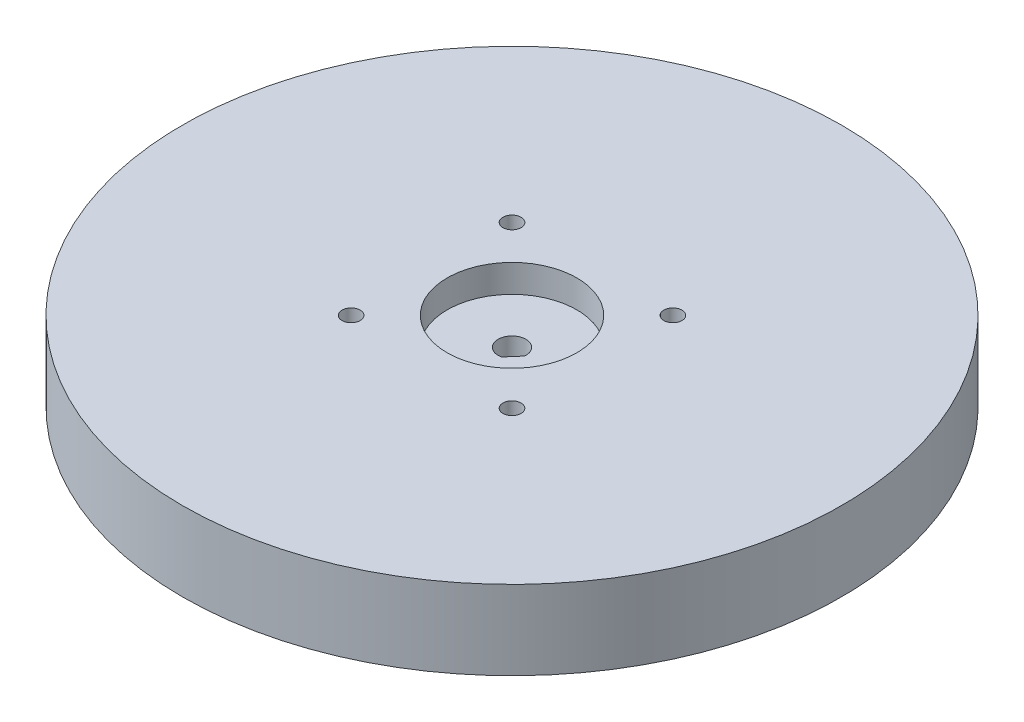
from build123d import *

# Parameters (mm, degrees)
SKETCH2_R           = 63.5
BOSS_EXTRUDE1_DEPTH = 15.24
CUT_EXTRUDE3_DEPTH  = 92.086539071
SKETCH4_R           = 1.75
CUT_EXTRUDE4_DEPTH  = 55.626
SKETCH5_R           = 12.5
CUT_EXTRUDE5_DEPTH  = 5.334


with BuildPart() as part:
    # Sketch2 → Boss-Extrude1 (new body)
    with BuildSketch(Plane(origin=(0, 0, 0), x_dir=(1, 0, 0), z_dir=(0, 1, 0))):
        with Locations(Location((0, 0, 0), (0, 0, 90))):
            Circle(SKETCH2_R)
    extrude(amount=BOSS_EXTRUDE1_DEPTH)

    # Sketch3 → Cut-Extrude3 (cut, through all)
    with BuildSketch(Plane(origin=(0, 15.24, 0), x_dir=(1, 0, 0), z_dir=(0, 1, 0))):
        with BuildLine():
            ThreePointArc((2.683094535, 0), (-2.104641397, 1.664175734), (0.618701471, -2.610786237))
            Line((0.618701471, -2.610786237), (2.670795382, -0.25660926))
            ThreePointArc((2.670795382, -0.25660926), (2.680017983, -0.128451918), (2.683094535, 0))
        make_face()
    extrude(amount=-CUT_EXTRUDE3_DEPTH, mode=Mode.SUBTRACT)

    # Sketch4 → Cut-Extrude4 (cut)
    with BuildSketch(Plane(origin=(0, 15.24, 0), x_dir=(1, 0, 0), z_dir=(0, 1, 0))):
        with Locations(Location((-15.5, 15.5, 0), (0, 0, 270))):
            Circle(SKETCH4_R)
        with Locations(Location((15.5, 15.5, 0), (0, 0, 270))):
            Circle(SKETCH4_R)
        with Locations(Location((15.5, -15.5, 0), (0, 0, 270))):
            Circle(SKETCH4_R)
        with Locations(Location((-15.5, -15.5, 0), (0, 0, 270))):
            Circle(SKETCH4_R)
    extrude(amount=-CUT_EXTRUDE4_DEPTH, mode=Mode.SUBTRACT)

    # Sketch5 → Cut-Extrude5 (cut)
    with BuildSketch(Plane(origin=(0, 15.24, 0), x_dir=(1, 0, 0), z_dir=(0, 1, 0))):
        with Locations(Location((0, 0, 0), (0, 0, 270))):
            Circle(SKETCH5_R)
    extrude(amount=-CUT_EXTRUDE5_DEPTH, mode=Mode.SUBTRACT)


solid = part.part
